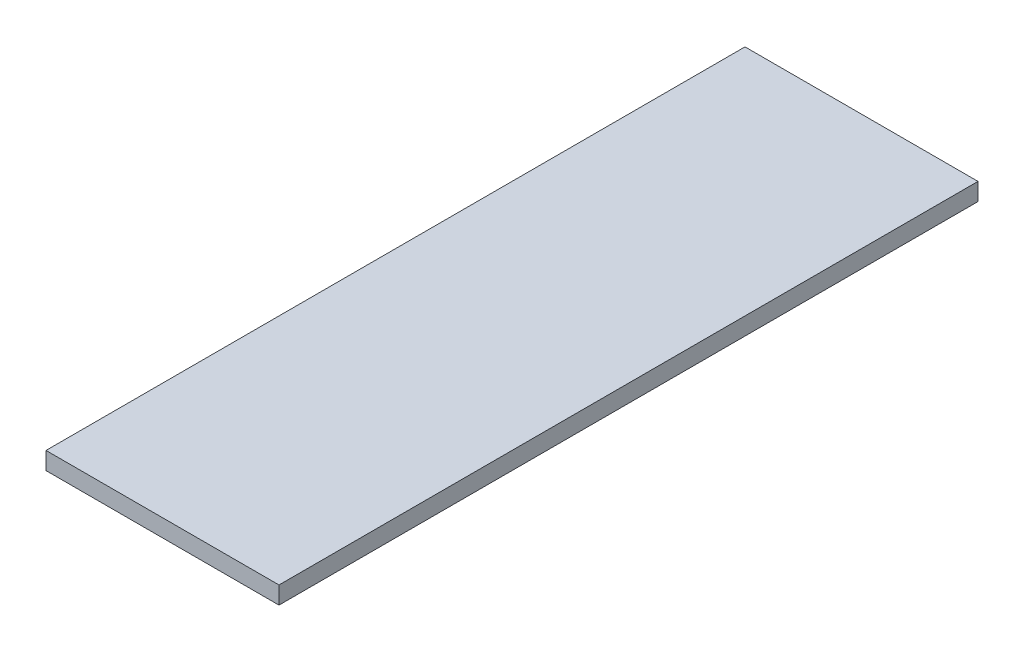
ISO-10303-21;
HEADER;
FILE_DESCRIPTION(('STEP AP214'),'2;1');
FILE_NAME('part.step','',(''),(''),'','','');
FILE_SCHEMA(('AUTOMOTIVE_DESIGN { 1 0 10303 214 1 1 1 1 }'));
ENDSEC;
DATA;
#1=APPLICATION_CONTEXT('core data for automotive mechanical design processes');
#2=APPLICATION_PROTOCOL_DEFINITION('international standard','automotive_design',2000,#1);
#3=PRODUCT_CONTEXT('',#1,'mechanical');
#4=PRODUCT('Part','Part','',(#3));
#5=PRODUCT_RELATED_PRODUCT_CATEGORY('part','',(#4));
#6=PRODUCT_DEFINITION_FORMATION('','',#4);
#7=PRODUCT_DEFINITION_CONTEXT('part definition',#1,'design');
#8=PRODUCT_DEFINITION('design','',#6,#7);
#9=PRODUCT_DEFINITION_SHAPE('','',#8);
#10=(LENGTH_UNIT() NAMED_UNIT(*) SI_UNIT(.MILLI.,.METRE.));
#11=(NAMED_UNIT(*) PLANE_ANGLE_UNIT() SI_UNIT($,.RADIAN.));
#12=(NAMED_UNIT(*) SI_UNIT($,.STERADIAN.) SOLID_ANGLE_UNIT());
#13=UNCERTAINTY_MEASURE_WITH_UNIT(LENGTH_MEASURE(1.E-05),#10,'distance_accuracy_value','');
#14=(GEOMETRIC_REPRESENTATION_CONTEXT(3) GLOBAL_UNCERTAINTY_ASSIGNED_CONTEXT((#13)) GLOBAL_UNIT_ASSIGNED_CONTEXT((#10,
#11,#12)) REPRESENTATION_CONTEXT('',''));
#15=CARTESIAN_POINT('',(0.,0.,0.));
#16=DIRECTION('',(0.,0.,1.));
#17=DIRECTION('',(1.,0.,0.));
#18=AXIS2_PLACEMENT_3D('',#15,#16,#17);
#19=CARTESIAN_POINT('',(-20.,95.,50.1123422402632));
#20=DIRECTION('',(0.,-1.,0.));
#21=DIRECTION('',(0.,0.,-1.));
#22=AXIS2_PLACEMENT_3D('',#19,#20,#21);
#23=PLANE('',#22);
#24=DIRECTION('',(0.,0.,-1.));
#25=VECTOR('',#24,1.);
#26=CARTESIAN_POINT('',(-20.,95.,50.1123422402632));
#27=LINE('',#26,#25);
#28=CARTESIAN_POINT('',(-20.,95.,10.));
#29=VERTEX_POINT('',#28);
#30=CARTESIAN_POINT('',(-20.,95.,-110.));
#31=VERTEX_POINT('',#30);
#32=EDGE_CURVE('E99',#29,#31,#27,.T.);
#33=ORIENTED_EDGE('',*,*,#32,.F.);
#34=DIRECTION('',(1.,0.,0.));
#35=VECTOR('',#34,1.);
#36=CARTESIAN_POINT('',(-20.,95.,10.));
#37=LINE('',#36,#35);
#38=CARTESIAN_POINT('',(20.,95.,10.));
#39=VERTEX_POINT('',#38);
#40=EDGE_CURVE('E37',#29,#39,#37,.T.);
#41=ORIENTED_EDGE('',*,*,#40,.T.);
#42=DIRECTION('',(0.,0.,-1.));
#43=VECTOR('',#42,1.);
#44=CARTESIAN_POINT('',(20.,95.,50.1123422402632));
#45=LINE('',#44,#43);
#46=CARTESIAN_POINT('',(20.,95.,-110.));
#47=VERTEX_POINT('',#46);
#48=EDGE_CURVE('E81',#39,#47,#45,.T.);
#49=ORIENTED_EDGE('',*,*,#48,.T.);
#50=DIRECTION('',(-1.,0.,0.));
#51=VECTOR('',#50,1.);
#52=CARTESIAN_POINT('',(-20.,95.,-110.));
#53=LINE('',#52,#51);
#54=EDGE_CURVE('E91',#47,#31,#53,.T.);
#55=ORIENTED_EDGE('',*,*,#54,.T.);
#56=EDGE_LOOP('',(#33,#41,#49,#55));
#57=FACE_BOUND('',#56,.T.);
#58=ADVANCED_FACE('F33',(#57),#23,.F.);
#59=CARTESIAN_POINT('',(20.,92.,50.1123422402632));
#60=DIRECTION('',(-1.,0.,0.));
#61=DIRECTION('',(0.,0.,1.));
#62=AXIS2_PLACEMENT_3D('',#59,#60,#61);
#63=PLANE('',#62);
#64=ORIENTED_EDGE('',*,*,#48,.F.);
#65=DIRECTION('',(0.,-1.,0.));
#66=VECTOR('',#65,1.);
#67=CARTESIAN_POINT('',(20.,92.,10.));
#68=LINE('',#67,#66);
#69=CARTESIAN_POINT('',(20.,92.,10.));
#70=VERTEX_POINT('',#69);
#71=EDGE_CURVE('E77',#39,#70,#68,.T.);
#72=ORIENTED_EDGE('',*,*,#71,.T.);
#73=DIRECTION('',(0.,0.,-1.));
#74=VECTOR('',#73,1.);
#75=CARTESIAN_POINT('',(20.,92.,50.1123422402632));
#76=LINE('',#75,#74);
#77=CARTESIAN_POINT('',(20.,92.,-110.));
#78=VERTEX_POINT('',#77);
#79=EDGE_CURVE('E72',#70,#78,#76,.T.);
#80=ORIENTED_EDGE('',*,*,#79,.T.);
#81=DIRECTION('',(0.,1.,0.));
#82=VECTOR('',#81,1.);
#83=CARTESIAN_POINT('',(20.,92.,-110.));
#84=LINE('',#83,#82);
#85=EDGE_CURVE('E76',#78,#47,#84,.T.);
#86=ORIENTED_EDGE('',*,*,#85,.T.);
#87=EDGE_LOOP('',(#64,#72,#80,#86));
#88=FACE_BOUND('',#87,.T.);
#89=ADVANCED_FACE('F75',(#88),#63,.F.);
#90=CARTESIAN_POINT('',(-20.,92.,50.1123422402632));
#91=DIRECTION('',(0.,1.,0.));
#92=DIRECTION('',(0.,0.,1.));
#93=AXIS2_PLACEMENT_3D('',#90,#91,#92);
#94=PLANE('',#93);
#95=ORIENTED_EDGE('',*,*,#79,.F.);
#96=DIRECTION('',(-1.,0.,0.));
#97=VECTOR('',#96,1.);
#98=CARTESIAN_POINT('',(-20.,92.,10.));
#99=LINE('',#98,#97);
#100=CARTESIAN_POINT('',(-20.,92.,10.));
#101=VERTEX_POINT('',#100);
#102=EDGE_CURVE('E42',#70,#101,#99,.T.);
#103=ORIENTED_EDGE('',*,*,#102,.T.);
#104=DIRECTION('',(0.,0.,-1.));
#105=VECTOR('',#104,1.);
#106=CARTESIAN_POINT('',(-20.,92.,50.1123422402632));
#107=LINE('',#106,#105);
#108=CARTESIAN_POINT('',(-20.,92.,-110.));
#109=VERTEX_POINT('',#108);
#110=EDGE_CURVE('E80',#101,#109,#107,.T.);
#111=ORIENTED_EDGE('',*,*,#110,.T.);
#112=DIRECTION('',(1.,0.,0.));
#113=VECTOR('',#112,1.);
#114=CARTESIAN_POINT('',(-20.,92.,-110.));
#115=LINE('',#114,#113);
#116=EDGE_CURVE('E88',#109,#78,#115,.T.);
#117=ORIENTED_EDGE('',*,*,#116,.T.);
#118=EDGE_LOOP('',(#95,#103,#111,#117));
#119=FACE_BOUND('',#118,.T.);
#120=ADVANCED_FACE('F93',(#119),#94,.F.);
#121=CARTESIAN_POINT('',(-20.,92.,50.1123422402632));
#122=DIRECTION('',(1.,0.,0.));
#123=DIRECTION('',(0.,0.,-1.));
#124=AXIS2_PLACEMENT_3D('',#121,#122,#123);
#125=PLANE('',#124);
#126=ORIENTED_EDGE('',*,*,#110,.F.);
#127=DIRECTION('',(0.,1.,0.));
#128=VECTOR('',#127,1.);
#129=CARTESIAN_POINT('',(-20.,92.,10.));
#130=LINE('',#129,#128);
#131=EDGE_CURVE('E11',#101,#29,#130,.T.);
#132=ORIENTED_EDGE('',*,*,#131,.T.);
#133=ORIENTED_EDGE('',*,*,#32,.T.);
#134=DIRECTION('',(0.,-1.,0.));
#135=VECTOR('',#134,1.);
#136=CARTESIAN_POINT('',(-20.,92.,-110.));
#137=LINE('',#136,#135);
#138=EDGE_CURVE('E97',#31,#109,#137,.T.);
#139=ORIENTED_EDGE('',*,*,#138,.T.);
#140=EDGE_LOOP('',(#126,#132,#133,#139));
#141=FACE_BOUND('',#140,.T.);
#142=ADVANCED_FACE('F35',(#141),#125,.F.);
#143=CARTESIAN_POINT('',(0.,0.,10.));
#144=DIRECTION('',(0.,0.,-1.));
#145=DIRECTION('',(-1.,0.,0.));
#146=AXIS2_PLACEMENT_3D('',#143,#144,#145);
#147=PLANE('',#146);
#148=ORIENTED_EDGE('',*,*,#102,.F.);
#149=ORIENTED_EDGE('',*,*,#71,.F.);
#150=ORIENTED_EDGE('',*,*,#40,.F.);
#151=ORIENTED_EDGE('',*,*,#131,.F.);
#152=EDGE_LOOP('',(#148,#149,#150,#151));
#153=FACE_BOUND('',#152,.T.);
#154=ADVANCED_FACE('F107',(#153),#147,.F.);
#155=CARTESIAN_POINT('',(0.,0.,-110.));
#156=DIRECTION('',(0.,0.,-1.));
#157=DIRECTION('',(-1.,0.,0.));
#158=AXIS2_PLACEMENT_3D('',#155,#156,#157);
#159=PLANE('',#158);
#160=ORIENTED_EDGE('',*,*,#138,.F.);
#161=ORIENTED_EDGE('',*,*,#54,.F.);
#162=ORIENTED_EDGE('',*,*,#85,.F.);
#163=ORIENTED_EDGE('',*,*,#116,.F.);
#164=EDGE_LOOP('',(#160,#161,#162,#163));
#165=FACE_BOUND('',#164,.T.);
#166=ADVANCED_FACE('F87',(#165),#159,.T.);
#167=CLOSED_SHELL('',(#58,#89,#120,#142,#154,#166));
#168=MANIFOLD_SOLID_BREP('B2',#167);
#169=ADVANCED_BREP_SHAPE_REPRESENTATION('',(#18,#168),#14);
#170=SHAPE_DEFINITION_REPRESENTATION(#9,#169);
ENDSEC;
END-ISO-10303-21;
